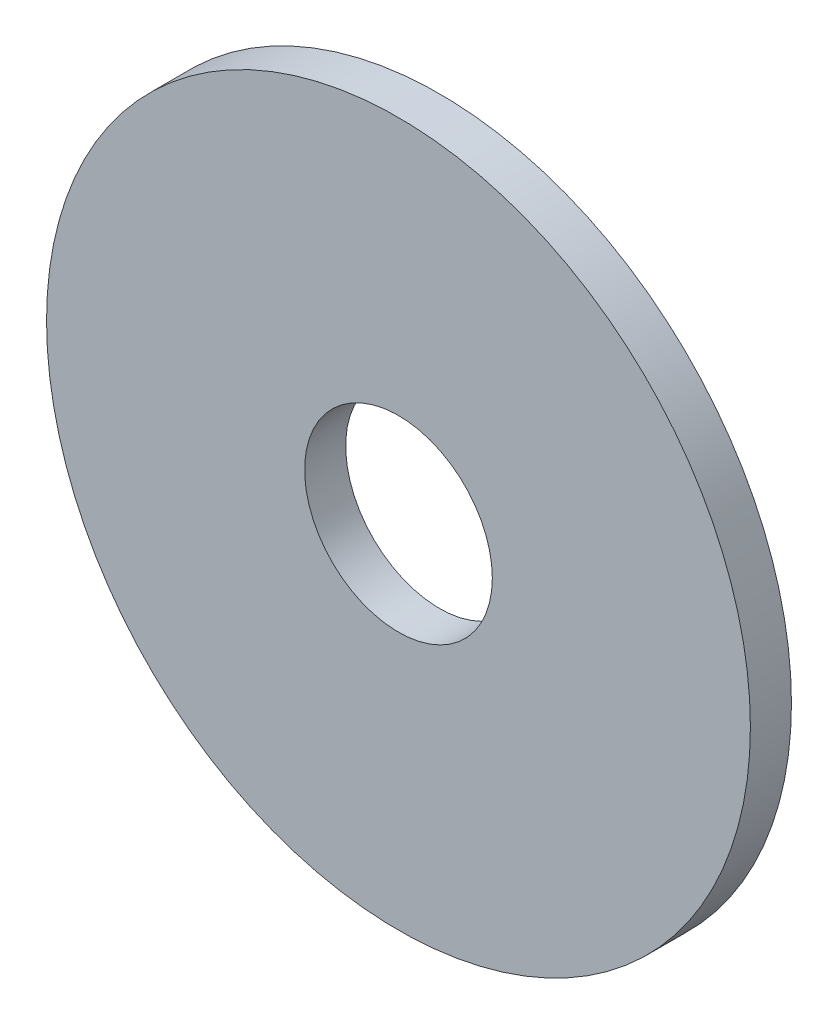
ISO-10303-21;
HEADER;
FILE_DESCRIPTION(('STEP AP214'),'2;1');
FILE_NAME('part.step','',(''),(''),'','','');
FILE_SCHEMA(('AUTOMOTIVE_DESIGN { 1 0 10303 214 1 1 1 1 }'));
ENDSEC;
DATA;
#1=APPLICATION_CONTEXT('core data for automotive mechanical design processes');
#2=APPLICATION_PROTOCOL_DEFINITION('international standard','automotive_design',2000,#1);
#3=PRODUCT_CONTEXT('',#1,'mechanical');
#4=PRODUCT('Part','Part','',(#3));
#5=PRODUCT_RELATED_PRODUCT_CATEGORY('part','',(#4));
#6=PRODUCT_DEFINITION_FORMATION('','',#4);
#7=PRODUCT_DEFINITION_CONTEXT('part definition',#1,'design');
#8=PRODUCT_DEFINITION('design','',#6,#7);
#9=PRODUCT_DEFINITION_SHAPE('','',#8);
#10=(LENGTH_UNIT() NAMED_UNIT(*) SI_UNIT(.MILLI.,.METRE.));
#11=(NAMED_UNIT(*) PLANE_ANGLE_UNIT() SI_UNIT($,.RADIAN.));
#12=(NAMED_UNIT(*) SI_UNIT($,.STERADIAN.) SOLID_ANGLE_UNIT());
#13=UNCERTAINTY_MEASURE_WITH_UNIT(LENGTH_MEASURE(1.E-05),#10,'distance_accuracy_value','');
#14=(GEOMETRIC_REPRESENTATION_CONTEXT(3) GLOBAL_UNCERTAINTY_ASSIGNED_CONTEXT((#13)) GLOBAL_UNIT_ASSIGNED_CONTEXT((#10,
#11,#12)) REPRESENTATION_CONTEXT('',''));
#15=CARTESIAN_POINT('',(0.,0.,0.));
#16=DIRECTION('',(0.,0.,1.));
#17=DIRECTION('',(1.,0.,0.));
#18=AXIS2_PLACEMENT_3D('',#15,#16,#17);
#19=CARTESIAN_POINT('',(0.,0.,0.7));
#20=DIRECTION('',(0.,0.,1.));
#21=DIRECTION('',(1.,0.,0.));
#22=AXIS2_PLACEMENT_3D('',#19,#20,#21);
#23=PLANE('',#22);
#24=CARTESIAN_POINT('',(0.,0.,0.7));
#25=DIRECTION('',(0.,0.,1.));
#26=DIRECTION('',(1.,0.,0.));
#27=AXIS2_PLACEMENT_3D('',#24,#25,#26);
#28=CIRCLE('',#27,6.);
#29=CARTESIAN_POINT('',(6.,0.,0.7));
#30=VERTEX_POINT('',#29);
#31=EDGE_CURVE('E10',#30,#30,#28,.T.);
#32=ORIENTED_EDGE('',*,*,#31,.T.);
#33=EDGE_LOOP('',(#32));
#34=FACE_BOUND('',#33,.T.);
#35=CARTESIAN_POINT('',(0.,0.,0.7));
#36=DIRECTION('',(0.,0.,1.));
#37=DIRECTION('',(1.,0.,0.));
#38=AXIS2_PLACEMENT_3D('',#35,#36,#37);
#39=CIRCLE('',#38,1.6);
#40=CARTESIAN_POINT('',(1.6,0.,0.7));
#41=VERTEX_POINT('',#40);
#42=EDGE_CURVE('E35',#41,#41,#39,.T.);
#43=ORIENTED_EDGE('',*,*,#42,.F.);
#44=EDGE_LOOP('',(#43));
#45=FACE_BOUND('',#44,.T.);
#46=ADVANCED_FACE('F24',(#34,#45),#23,.T.);
#47=CARTESIAN_POINT('',(0.,0.,0.));
#48=DIRECTION('',(0.,0.,1.));
#49=DIRECTION('',(1.,0.,0.));
#50=AXIS2_PLACEMENT_3D('',#47,#48,#49);
#51=PLANE('',#50);
#52=CARTESIAN_POINT('',(0.,0.,0.));
#53=DIRECTION('',(0.,0.,1.));
#54=DIRECTION('',(1.,0.,0.));
#55=AXIS2_PLACEMENT_3D('',#52,#53,#54);
#56=CIRCLE('',#55,6.);
#57=CARTESIAN_POINT('',(6.,0.,0.));
#58=VERTEX_POINT('',#57);
#59=EDGE_CURVE('E31',#58,#58,#56,.T.);
#60=ORIENTED_EDGE('',*,*,#59,.F.);
#61=EDGE_LOOP('',(#60));
#62=FACE_BOUND('',#61,.T.);
#63=CARTESIAN_POINT('',(0.,0.,0.));
#64=DIRECTION('',(0.,0.,1.));
#65=DIRECTION('',(1.,0.,0.));
#66=AXIS2_PLACEMENT_3D('',#63,#64,#65);
#67=CIRCLE('',#66,1.6);
#68=CARTESIAN_POINT('',(1.6,0.,0.));
#69=VERTEX_POINT('',#68);
#70=EDGE_CURVE('E39',#69,#69,#67,.T.);
#71=ORIENTED_EDGE('',*,*,#70,.T.);
#72=EDGE_LOOP('',(#71));
#73=FACE_BOUND('',#72,.T.);
#74=ADVANCED_FACE('F45',(#62,#73),#51,.F.);
#75=CARTESIAN_POINT('',(0.,0.,0.7));
#76=DIRECTION('',(0.,0.,-1.));
#77=DIRECTION('',(-1.,0.,0.));
#78=AXIS2_PLACEMENT_3D('',#75,#76,#77);
#79=CYLINDRICAL_SURFACE('',#78,6.);
#80=ORIENTED_EDGE('',*,*,#31,.F.);
#81=EDGE_LOOP('',(#80));
#82=FACE_BOUND('',#81,.T.);
#83=ORIENTED_EDGE('',*,*,#59,.T.);
#84=EDGE_LOOP('',(#83));
#85=FACE_BOUND('',#84,.T.);
#86=ADVANCED_FACE('F26',(#82,#85),#79,.T.);
#87=CARTESIAN_POINT('',(0.,0.,0.7));
#88=DIRECTION('',(0.,0.,-1.));
#89=DIRECTION('',(-1.,0.,0.));
#90=AXIS2_PLACEMENT_3D('',#87,#88,#89);
#91=CYLINDRICAL_SURFACE('',#90,1.6);
#92=ORIENTED_EDGE('',*,*,#42,.T.);
#93=EDGE_LOOP('',(#92));
#94=FACE_BOUND('',#93,.T.);
#95=ORIENTED_EDGE('',*,*,#70,.F.);
#96=EDGE_LOOP('',(#95));
#97=FACE_BOUND('',#96,.T.);
#98=ADVANCED_FACE('F47',(#94,#97),#91,.F.);
#99=CLOSED_SHELL('',(#46,#74,#86,#98));
#100=MANIFOLD_SOLID_BREP('B2',#99);
#101=ADVANCED_BREP_SHAPE_REPRESENTATION('',(#18,#100),#14);
#102=SHAPE_DEFINITION_REPRESENTATION(#9,#101);
ENDSEC;
END-ISO-10303-21;
